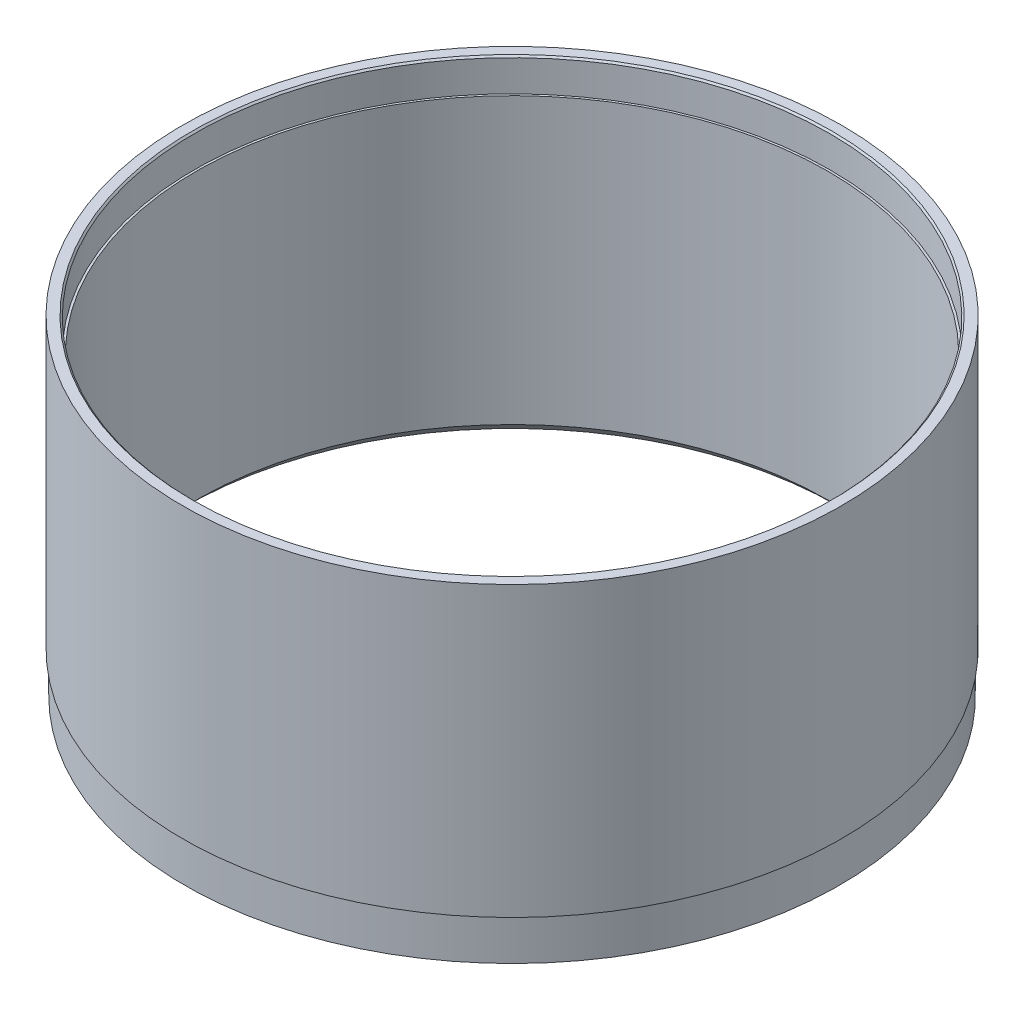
from build123d import *

# Parameters (mm, degrees)
SKETCH1_R          = 152.4
SKETCH1_R_2        = 146.05
EXTRUDE1_DEPTH     = 152.4
CHAMFER2_SIZE      = 5.461
SKETCH2_R          = 147.066
CUT_EXTRUDE1_DEPTH = 15.24
CHAMFER3_SIZE      = 0.762
SKETCH3_R          = 166.20663156
SKETCH3_R_2        = 151.511
CUT_EXTRUDE3_DEPTH = 19.05


with BuildPart() as part:
    # Sketch1 → Extrude1 (new body)
    with BuildSketch(Plane(origin=(0, 0, 0), x_dir=(1, 0, 0), z_dir=(0, 1, 0))):
        with Locations(Location((0, 0, 0), (0, 0, 90))):
            Circle(SKETCH1_R)
        with Locations(Location((0, 0, 0), (0, 0, 90))):
            Circle(SKETCH1_R_2, mode=Mode.SUBTRACT)
    extrude(amount=EXTRUDE1_DEPTH)

    # Chamfer2
    chamfer2_edges = [part.edges().sort_by_distance(p)[0] for p in [
        (0, 0, 146.05),
    ]]
    chamfer(chamfer2_edges, length=CHAMFER2_SIZE)

    # Sketch2 → Cut-Extrude1 (cut)
    with BuildSketch(Plane(origin=(0, 152.4, 0), x_dir=(-1, 0, 0), z_dir=(0, 1, 0))):
        with Locations(Location((0, 0, 0), (0, 0, 90))):
            Circle(SKETCH2_R)
    extrude(amount=-CUT_EXTRUDE1_DEPTH, mode=Mode.SUBTRACT)

    # Chamfer3
    chamfer3_edges = [part.edges().sort_by_distance(p)[0] for p in [
        (0, 152.4, -147.066),
    ]]
    chamfer(chamfer3_edges, length=CHAMFER3_SIZE)

    # Sketch3 → Cut-Extrude3 (cut)
    with BuildSketch(Plane(origin=(0, 0, 0), x_dir=(1, 0, 0), z_dir=(0, 1, 0))):
        Circle(SKETCH3_R)
        with Locations(Location((0, 0, 0), (0, 0, 90))):
            Circle(SKETCH3_R_2, mode=Mode.SUBTRACT)
    extrude(amount=CUT_EXTRUDE3_DEPTH, mode=Mode.SUBTRACT)


solid = part.part
